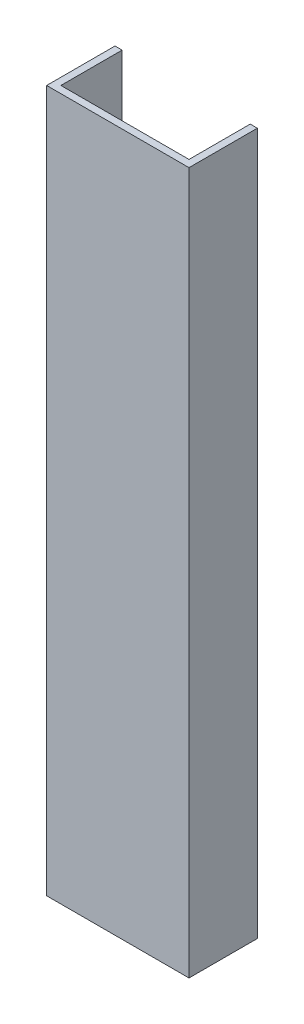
from build123d import *

# Parameters (mm, degrees)
BOSS_EXTRUDE1_DEPTH = 493


with BuildPart() as part:
    # Sketch1 → Boss-Extrude1 (new body)
    with BuildSketch(Plane(origin=(0, 0, 0), x_dir=(1, 0, 0), z_dir=(0, 1, 0))):
        Polygon((45, 48), (45, 5), (-45, 5), (-45, 48), (-50, 48), (-50, 0), (50, 0), (50, 48), align=None)
    extrude(amount=BOSS_EXTRUDE1_DEPTH)


solid = part.part
